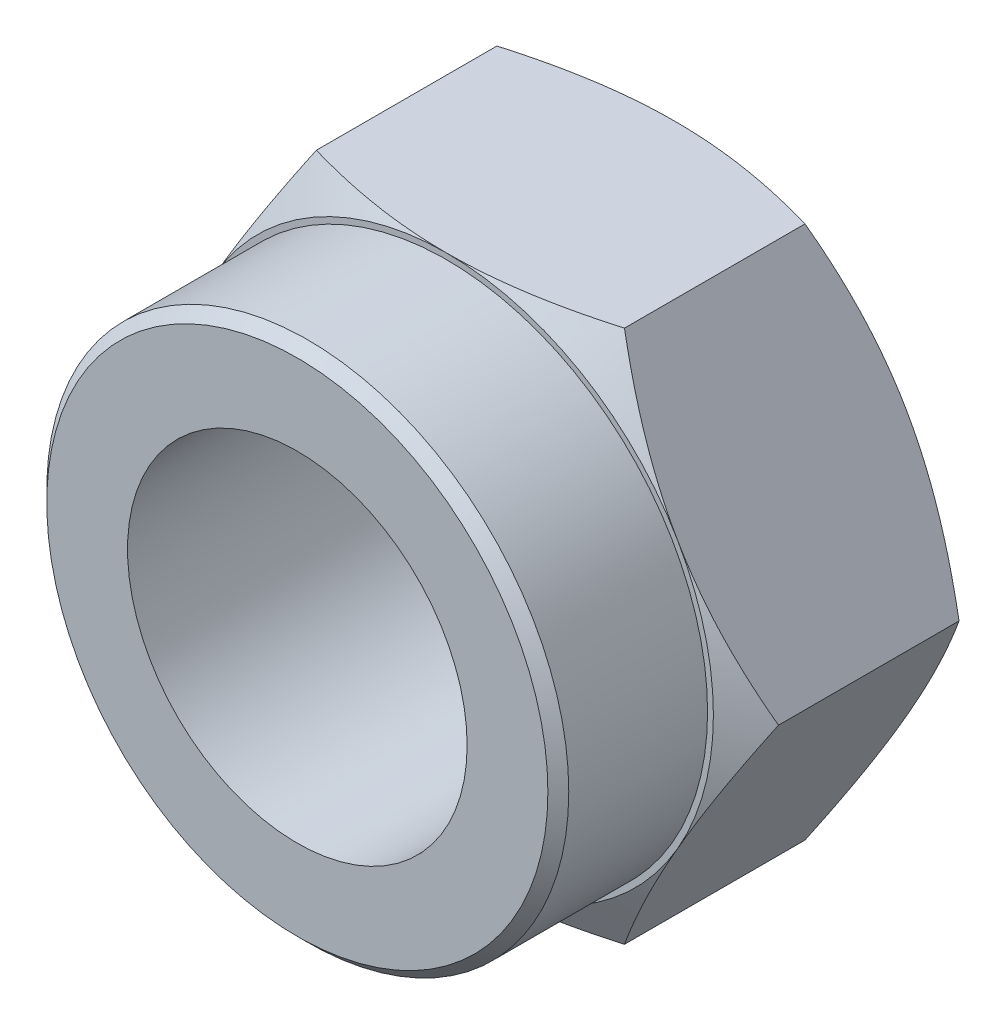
from build123d import *

# Parameters (mm, degrees)
SKETCH1_R      = 17.5
BASENUT_DEPTH  = 23.52
EXTRUDE1_START = 15.38
SKETCH2_R      = 26.9
SKETCH2_R_2    = 17.5
EXTRUDE1_DEPTH = 15.38
CHAMFER1_SIZE  = 1.076


with BuildPart() as part:
    # Sketch1 → BaseNut (new body)
    with BuildSketch(Plane.XY):
        Polygon((15.877132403, -27.5), (31.754264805, 0), (15.877132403, 27.5), (-15.877132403, 27.5), (-31.754264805, 0), (-15.877132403, -27.5), align=None)
        Circle(SKETCH1_R, mode=Mode.SUBTRACT)
    extrude(amount=-BASENUT_DEPTH)

    # Sketch3 → Double-Chamfer (revolve, cut)
    with BuildSketch(Plane(origin=(0, 0, 0), x_dir=(1, 0, 0), z_dir=(0, 1, 0))):
        Polygon((27.5, 23.52), (31.754264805, 23.52), (31.754264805, 21.063799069), align=None)
        Polygon((31.754264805, 2.456200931), (27.5, 0), (31.754264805, 0), align=None)
    revolve(axis=Axis((0, 0, -16.31077227), (0, 0, 1)), mode=Mode.SUBTRACT)

    # Sketch2 → Extrude1 (add)
    with BuildSketch(Plane(origin=(19.181370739, 9.516836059, 0), x_dir=(1, 0, 0), z_dir=(0, 0, 1)).offset(EXTRUDE1_START)):
        with Locations((-19.181370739, -9.516836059)):
            Circle(SKETCH2_R)
        with Locations((-19.181370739, -9.516836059)):
            Circle(SKETCH2_R_2, mode=Mode.SUBTRACT)
    extrude(amount=-EXTRUDE1_DEPTH)

    # Sketch5 → EndChamfer (revolve, cut)
    with BuildSketch(Plane(origin=(0, 0, 0), x_dir=(1, 0, 0), z_dir=(0, 1, 0))):
        Polygon((17.5, 23.52), (19.45, 23.52), (17.5, 22.394166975), align=None)
    revolve(axis=Axis((0, 0, -16.800797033), (0, 0, 1)), mode=Mode.SUBTRACT)

    # Chamfer1
    chamfer1_edges = [part.edges().sort_by_distance(p)[0] for p in [
        (-26.9, 0, 15.38),
    ]]
    chamfer(chamfer1_edges, length=CHAMFER1_SIZE)


solid = part.part
